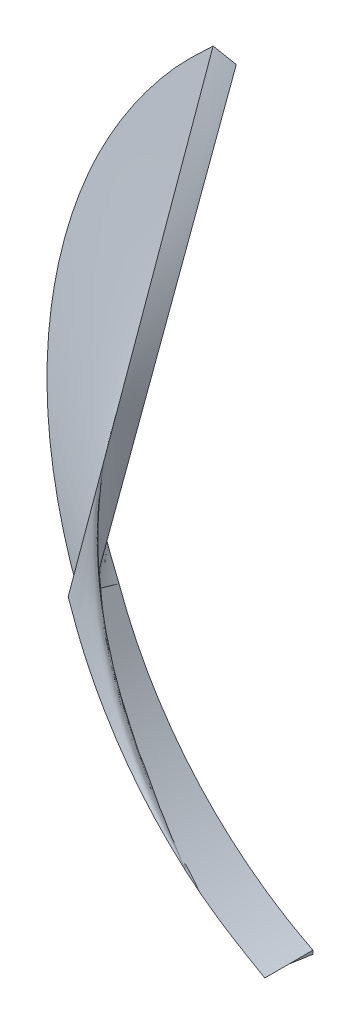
ISO-10303-21;
HEADER;
FILE_DESCRIPTION(('STEP AP214'),'2;1');
FILE_NAME('part.step','',(''),(''),'','','');
FILE_SCHEMA(('AUTOMOTIVE_DESIGN { 1 0 10303 214 1 1 1 1 }'));
ENDSEC;
DATA;
#1=APPLICATION_CONTEXT('core data for automotive mechanical design processes');
#2=APPLICATION_PROTOCOL_DEFINITION('international standard','automotive_design',2000,#1);
#3=PRODUCT_CONTEXT('',#1,'mechanical');
#4=PRODUCT('Part','Part','',(#3));
#5=PRODUCT_RELATED_PRODUCT_CATEGORY('part','',(#4));
#6=PRODUCT_DEFINITION_FORMATION('','',#4);
#7=PRODUCT_DEFINITION_CONTEXT('part definition',#1,'design');
#8=PRODUCT_DEFINITION('design','',#6,#7);
#9=PRODUCT_DEFINITION_SHAPE('','',#8);
#10=(LENGTH_UNIT() NAMED_UNIT(*) SI_UNIT(.MILLI.,.METRE.));
#11=(NAMED_UNIT(*) PLANE_ANGLE_UNIT() SI_UNIT($,.RADIAN.));
#12=(NAMED_UNIT(*) SI_UNIT($,.STERADIAN.) SOLID_ANGLE_UNIT());
#13=UNCERTAINTY_MEASURE_WITH_UNIT(LENGTH_MEASURE(1.E-05),#10,'distance_accuracy_value','');
#14=(GEOMETRIC_REPRESENTATION_CONTEXT(3) GLOBAL_UNCERTAINTY_ASSIGNED_CONTEXT((#13)) GLOBAL_UNIT_ASSIGNED_CONTEXT((#10,
#11,#12)) REPRESENTATION_CONTEXT('',''));
#15=CARTESIAN_POINT('',(0.,0.,0.));
#16=DIRECTION('',(0.,0.,1.));
#17=DIRECTION('',(1.,0.,0.));
#18=AXIS2_PLACEMENT_3D('',#15,#16,#17);
#19=CARTESIAN_POINT('',(-28.2525641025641,-60.4671431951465,22.6547696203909));
#20=DIRECTION('',(0.,0.,-1.));
#21=DIRECTION('',(-1.,0.,0.));
#22=AXIS2_PLACEMENT_3D('',#19,#20,#21);
#23=CYLINDRICAL_SURFACE('',#22,17.5);
#24=CARTESIAN_POINT('',(-35.7525641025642,-76.2785314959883,6.32363904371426));
#25=DIRECTION('',(0.,0.,-1.));
#26=VECTOR('',#25,1.);
#27=LINE('',#24,#26);
#28=CARTESIAN_POINT('',(-35.7525641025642,-76.2785314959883,6.32363904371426));
#29=VERTEX_POINT('',#28);
#30=CARTESIAN_POINT('',(-35.7525641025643,-76.2785314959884,5.28894384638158));
#31=VERTEX_POINT('',#30);
#32=EDGE_CURVE('E137',#29,#31,#27,.T.);
#33=ORIENTED_EDGE('',*,*,#32,.T.);
#34=CARTESIAN_POINT('',(-28.2525641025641,-60.4671431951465,4.69415557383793));
#35=DIRECTION('',(0.,0.03759112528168,0.999293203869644));
#36=DIRECTION('',(0.,0.999293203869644,-0.03759112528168));
#37=AXIS2_PLACEMENT_3D('',#34,#35,#36);
#38=ELLIPSE('',#37,17.5123776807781,17.5);
#39=CARTESIAN_POINT('',(-44.4232075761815,-67.157456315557,4.94582985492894));
#40=VERTEX_POINT('',#39);
#41=EDGE_CURVE('E147',#40,#31,#38,.T.);
#42=ORIENTED_EDGE('',*,*,#41,.F.);
#43=CARTESIAN_POINT('',(-44.5128678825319,-66.9365029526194,5.9505367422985));
#44=CARTESIAN_POINT('',(-44.5092847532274,-66.9455089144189,5.90861779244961));
#45=CARTESIAN_POINT('',(-44.5056831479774,-66.9545394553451,5.86670570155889));
#46=CARTESIAN_POINT('',(-44.4984425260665,-66.9726500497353,5.78289536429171));
#47=CARTESIAN_POINT('',(-44.494803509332,-66.9817301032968,5.74099711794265));
#48=CARTESIAN_POINT('',(-44.4874876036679,-66.9999400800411,5.65721458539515));
#49=CARTESIAN_POINT('',(-44.4838107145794,-67.0090700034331,5.61533029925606));
#50=CARTESIAN_POINT('',(-44.4764186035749,-67.0273800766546,5.53157580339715));
#51=CARTESIAN_POINT('',(-44.4727033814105,-67.0365602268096,5.48970559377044));
#52=CARTESIAN_POINT('',(-44.4652341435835,-67.0549711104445,5.40597936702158));
#53=CARTESIAN_POINT('',(-44.4614801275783,-67.064201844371,5.36412335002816));
#54=CARTESIAN_POINT('',(-44.4539328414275,-67.0827142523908,5.28042562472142));
#55=CARTESIAN_POINT('',(-44.4501395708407,-67.0919959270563,5.23858391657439));
#56=CARTESIAN_POINT('',(-44.4425133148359,-67.110610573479,5.15491492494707));
#57=CARTESIAN_POINT('',(-44.4386803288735,-67.1199435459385,5.11308764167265));
#58=CARTESIAN_POINT('',(-44.4309741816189,-67.138661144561,5.02944761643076));
#59=CARTESIAN_POINT('',(-44.4271010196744,-67.1480457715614,4.9876348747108));
#60=CARTESIAN_POINT('',(-44.4232075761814,-67.1574563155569,4.94582985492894));
#61=B_SPLINE_CURVE_WITH_KNOTS('',3,(#43,#44,#45,#46,#47,#48,#49,#50,#51,#52,#53,#54,#55,#56,#57,
#58,#59,#60),.UNSPECIFIED.,.F.,.F.,(4,2,2,2,2,2,2,2,4),(0.,0.129074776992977,0.258149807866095,
0.387225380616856,0.516301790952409,0.645379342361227,0.774458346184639,0.903539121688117,
1.0326219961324),.UNSPECIFIED.);
#62=CARTESIAN_POINT('',(-44.5128670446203,-66.9365026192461,5.9505367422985));
#63=VERTEX_POINT('',#62);
#64=EDGE_CURVE('E258',#63,#40,#61,.T.);
#65=ORIENTED_EDGE('',*,*,#64,.F.);
#66=CARTESIAN_POINT('',(-44.5954336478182,-66.7249874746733,6.95787947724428));
#67=CARTESIAN_POINT('',(-44.5866276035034,-66.7479851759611,6.8458126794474));
#68=CARTESIAN_POINT('',(-44.568778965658,-66.7943098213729,6.62177009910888));
#69=CARTESIAN_POINT('',(-44.541270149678,-66.8648048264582,6.28598588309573));
#70=CARTESIAN_POINT('',(-44.5224228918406,-66.9124870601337,6.06232058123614));
#71=CARTESIAN_POINT('',(-44.5128678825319,-66.9365029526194,5.9505367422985));
#72=B_SPLINE_CURVE_WITH_KNOTS('',3,(#66,#67,#68,#69,#70,#71),.UNSPECIFIED.,.F.,.F.,(4,1,1,4),
(0.,0.166666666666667,0.333333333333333,0.5),.UNSPECIFIED.);
#73=CARTESIAN_POINT('',(-44.5954336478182,-66.7249874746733,6.95787947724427));
#74=VERTEX_POINT('',#73);
#75=EDGE_CURVE('E282',#74,#63,#72,.T.);
#76=ORIENTED_EDGE('',*,*,#75,.F.);
#77=CARTESIAN_POINT('',(-35.7525641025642,-76.2785314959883,7.35833424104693));
#78=CARTESIAN_POINT('',(-35.7854644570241,-76.2607661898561,7.35758957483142));
#79=CARTESIAN_POINT('',(-36.0268619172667,-76.130418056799,7.35212578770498));
#80=CARTESIAN_POINT('',(-36.2893312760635,-75.9883176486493,7.34616938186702));
#81=CARTESIAN_POINT('',(-36.7388587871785,-75.7404516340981,7.33577961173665));
#82=CARTESIAN_POINT('',(-37.1924590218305,-75.4850775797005,7.3250751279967));
#83=CARTESIAN_POINT('',(-37.6430114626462,-75.2137593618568,7.31370231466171));
#84=CARTESIAN_POINT('',(-38.0501706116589,-74.9555704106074,7.3028798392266));
#85=CARTESIAN_POINT('',(-38.2762264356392,-74.8055966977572,7.29659340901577));
#86=CARTESIAN_POINT('',(-38.5031756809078,-74.6463093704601,7.28991658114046));
#87=CARTESIAN_POINT('',(-38.5914341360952,-74.5833726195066,7.28727846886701));
#88=CARTESIAN_POINT('',(-38.6847769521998,-74.515609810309,7.28443806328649));
#89=CARTESIAN_POINT('',(-38.7831092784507,-74.4428658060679,7.28138886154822));
#90=CARTESIAN_POINT('',(-38.8809306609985,-74.3691681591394,7.27829968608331));
#91=CARTESIAN_POINT('',(-39.0375141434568,-74.2491012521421,7.27326685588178));
#92=CARTESIAN_POINT('',(-39.2567447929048,-74.0754376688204,7.26598742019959));
#93=CARTESIAN_POINT('',(-39.5619663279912,-73.8224785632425,7.2553841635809));
#94=CARTESIAN_POINT('',(-39.8358890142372,-73.5843321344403,7.2454018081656));
#95=CARTESIAN_POINT('',(-40.056881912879,-73.3851932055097,7.23705452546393));
#96=CARTESIAN_POINT('',(-40.2632005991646,-73.1948837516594,7.22907734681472));
#97=CARTESIAN_POINT('',(-40.4365810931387,-73.0291979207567,7.22213231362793));
#98=CARTESIAN_POINT('',(-40.6367752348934,-72.8318104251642,7.21385844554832));
#99=CARTESIAN_POINT('',(-40.8345546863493,-72.6320066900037,7.2054832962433));
#100=CARTESIAN_POINT('',(-41.0966759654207,-72.3557985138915,7.19390551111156));
#101=CARTESIAN_POINT('',(-41.3518328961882,-72.0731504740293,7.18205778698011));
#102=CARTESIAN_POINT('',(-41.5358559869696,-71.8604809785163,7.17314334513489));
#103=CARTESIAN_POINT('',(-41.7171974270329,-71.6456515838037,7.16413836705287));
#104=CARTESIAN_POINT('',(-41.8689556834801,-71.4599945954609,7.15635620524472));
#105=CARTESIAN_POINT('',(-42.0429913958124,-71.2395662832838,7.14711653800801));
#106=CARTESIAN_POINT('',(-42.2244898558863,-71.0038679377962,7.13723679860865));
#107=CARTESIAN_POINT('',(-42.4395101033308,-70.7121599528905,7.1250093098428));
#108=CARTESIAN_POINT('',(-42.6666025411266,-70.3882198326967,7.11143075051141));
#109=CARTESIAN_POINT('',(-42.8225117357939,-70.1561876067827,7.10170468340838));
#110=CARTESIAN_POINT('',(-42.9305711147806,-69.9908841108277,7.09477567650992));
#111=CARTESIAN_POINT('',(-42.9970217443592,-69.8877605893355,7.09045306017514));
#112=CARTESIAN_POINT('',(-43.0629184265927,-69.7840216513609,7.08610464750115));
#113=CARTESIAN_POINT('',(-43.12434906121,-69.6859180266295,7.08199244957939));
#114=CARTESIAN_POINT('',(-43.1815946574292,-69.5932974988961,7.07811008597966));
#115=CARTESIAN_POINT('',(-43.3266974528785,-69.3556665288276,7.06814933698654));
#116=CARTESIAN_POINT('',(-43.464396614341,-69.1197074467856,7.05825866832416));
#117=CARTESIAN_POINT('',(-43.7006136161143,-68.6937040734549,7.04040193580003));
#118=CARTESIAN_POINT('',(-43.9447201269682,-68.2250224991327,7.02075626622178));
#119=CARTESIAN_POINT('',(-44.1594154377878,-67.7521943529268,7.00093678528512));
#120=CARTESIAN_POINT('',(-44.3623061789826,-67.2851650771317,6.98136037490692));
#121=CARTESIAN_POINT('',(-44.4766362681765,-67.0112592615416,6.96987909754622));
#122=CARTESIAN_POINT('',(-44.5811846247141,-66.7593240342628,6.95931875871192));
#123=CARTESIAN_POINT('',(-44.5954336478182,-66.7249874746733,6.95787947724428));
#124=B_SPLINE_CURVE_WITH_KNOTS('',3,(#77,#78,#79,#80,#81,#82,#83,#84,#85,#86,#87,#88,#89,#90,
#91,#92,#93,#94,#95,#96,#97,#98,#99,#100,#101,#102,#103,#104,#105,#106,#107,#108,#109,#110,#111,
#112,#113,#114,#115,#116,#117,#118,#119,#120,#121,#122,#123),.UNSPECIFIED.,.F.,.F.,(4,1,1,1,1,1,
1,1,1,1,1,1,1,1,1,1,1,1,1,1,1,1,1,1,1,1,1,1,1,1,1,1,1,1,1,1,1,1,1,1,1,1,1,1,4),(0.,
0.0085182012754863,0.0625,0.0679937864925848,0.125427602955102,0.181004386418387,0.1875,
0.234747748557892,0.242373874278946,0.25,0.259154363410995,0.268308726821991,0.277463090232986,
0.286617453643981,0.3125,0.339963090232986,0.375,0.393308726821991,0.406220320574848,0.4375,
0.446654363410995,0.468740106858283,0.5,0.531259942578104,0.553345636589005,0.562519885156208,
0.593779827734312,0.606691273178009,0.625039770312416,0.660036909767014,0.6875,
0.713382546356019,0.722536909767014,0.731691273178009,0.740845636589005,0.750061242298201,
0.757626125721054,0.765252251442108,0.8125,0.818995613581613,0.875028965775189,
0.932006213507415,0.9375,0.991481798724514,1.),.UNSPECIFIED.);
#125=CARTESIAN_POINT('',(-35.7525641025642,-76.2785314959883,7.35833424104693));
#126=VERTEX_POINT('',#125);
#127=EDGE_CURVE('E123',#126,#74,#124,.T.);
#128=ORIENTED_EDGE('',*,*,#127,.F.);
#129=CARTESIAN_POINT('',(-35.7525641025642,-76.2785314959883,6.32363904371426));
#130=CARTESIAN_POINT('',(-35.7525641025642,-76.2785314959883,6.43860517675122));
#131=CARTESIAN_POINT('',(-35.7525641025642,-76.2785314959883,6.66853744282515));
#132=CARTESIAN_POINT('',(-35.7525641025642,-76.2785314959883,7.01343584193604));
#133=CARTESIAN_POINT('',(-35.7525641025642,-76.2785314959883,7.24336810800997));
#134=CARTESIAN_POINT('',(-35.7525641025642,-76.2785314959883,7.35833424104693));
#135=B_SPLINE_CURVE_WITH_KNOTS('',3,(#129,#130,#131,#132,#133,#134),.UNSPECIFIED.,.F.,.F.,(4,1,
1,4),(0.,0.166666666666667,0.333333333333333,0.5),.UNSPECIFIED.);
#136=EDGE_CURVE('E141',#126,#29,#135,.F.);
#137=ORIENTED_EDGE('',*,*,#136,.T.);
#138=EDGE_LOOP('',(#33,#42,#65,#76,#128,#137));
#139=FACE_BOUND('',#138,.T.);
#140=ADVANCED_FACE('F103',(#139),#23,.F.);
#141=CARTESIAN_POINT('',(-35.7525641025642,-76.2785314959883,7.35833424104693));
#142=CARTESIAN_POINT('',(-35.7525641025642,-76.2785314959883,7.24336810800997));
#143=CARTESIAN_POINT('',(-35.7525641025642,-76.2785314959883,7.01343584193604));
#144=CARTESIAN_POINT('',(-35.7525641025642,-76.2785314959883,6.66853744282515));
#145=CARTESIAN_POINT('',(-35.7525641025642,-76.2785314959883,6.43860517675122));
#146=CARTESIAN_POINT('',(-35.7525641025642,-76.2785314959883,6.32363904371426));
#147=CARTESIAN_POINT('',(-39.5562566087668,-76.4318356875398,5.29471079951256));
#148=CARTESIAN_POINT('',(-39.1336241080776,-76.4318356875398,5.29471079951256));
#149=CARTESIAN_POINT('',(-38.2883591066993,-76.4318356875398,5.29471079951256));
#150=CARTESIAN_POINT('',(-37.0204616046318,-76.4318356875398,5.29471079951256));
#151=CARTESIAN_POINT('',(-36.1751966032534,-76.4318356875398,5.29471079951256));
#152=CARTESIAN_POINT('',(-35.7525641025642,-76.4318356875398,5.29471079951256));
#153=B_SPLINE_SURFACE_WITH_KNOTS('',1,3,((#141,#142,#143,#144,#145,#146),(#147,#148,#149,#150,
#151,#152)),.UNSPECIFIED.,.F.,.F.,.F.,(2,2),(4,1,1,4),(0.,1.),(0.,0.166666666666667,
0.333333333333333,0.5),.UNSPECIFIED.);
#154=DIRECTION('',(0.878422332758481,0.0354039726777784,0.476571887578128));
#155=VECTOR('',#154,1.);
#156=CARTESIAN_POINT('',(-37.6544103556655,-76.3551835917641,6.32652252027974));
#157=LINE('',#156,#155);
#158=CARTESIAN_POINT('',(-39.5562566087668,-76.4318356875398,5.29471079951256));
#159=VERTEX_POINT('',#158);
#160=EDGE_CURVE('E377',#159,#126,#157,.T.);
#161=CARTESIAN_POINT('',(-39.5562566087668,-76.4318356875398,5.29471079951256));
#162=CARTESIAN_POINT('',(-39.1336241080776,-76.4318356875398,5.29471079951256));
#163=CARTESIAN_POINT('',(-38.2883591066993,-76.4318356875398,5.29471079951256));
#164=CARTESIAN_POINT('',(-37.0204616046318,-76.4318356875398,5.29471079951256));
#165=CARTESIAN_POINT('',(-36.1751966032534,-76.4318356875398,5.29471079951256));
#166=CARTESIAN_POINT('',(-35.7525641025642,-76.4318356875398,5.29471079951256));
#167=B_SPLINE_CURVE_WITH_KNOTS('',3,(#161,#162,#163,#164,#165,#166),.UNSPECIFIED.,.F.,.F.,(4,1,
1,4),(0.,0.166666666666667,0.333333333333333,0.5),.UNSPECIFIED.);
#168=CARTESIAN_POINT('',(-35.7525641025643,-76.4318356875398,5.29471079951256));
#169=VERTEX_POINT('',#168);
#170=EDGE_CURVE('E164',#159,#169,#167,.T.);
#171=CARTESIAN_POINT('',(-35.7525641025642,-76.4318356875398,5.29471079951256));
#172=CARTESIAN_POINT('',(-35.7525641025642,-76.2785314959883,6.32363904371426));
#173=B_SPLINE_CURVE_WITH_KNOTS('',1,(#171,#172),.UNSPECIFIED.,.F.,.F.,(2,2),(0.,1.),.UNSPECIFIED.);
#174=EDGE_CURVE('E153',#29,#169,#173,.F.);
#175=ORIENTED_EDGE('',*,*,#160,.F.);
#176=ORIENTED_EDGE('',*,*,#170,.T.);
#177=ORIENTED_EDGE('',*,*,#174,.F.);
#178=ORIENTED_EDGE('',*,*,#136,.F.);
#179=EDGE_LOOP('',(#175,#176,#177,#178));
#180=FACE_BOUND('',#179,.T.);
#181=ADVANCED_FACE('F162',(#180),#153,.T.);
#182=CARTESIAN_POINT('',(-35.7525641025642,-76.2785314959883,6.32363904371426));
#183=DIRECTION('',(1.,0.,0.));
#184=DIRECTION('',(0.,-0.147367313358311,-0.989081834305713));
#185=AXIS2_PLACEMENT_3D('',#182,#183,#184);
#186=PLANE('',#185);
#187=ORIENTED_EDGE('',*,*,#174,.T.);
#188=CARTESIAN_POINT('',(-35.7525641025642,-76.4318356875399,5.29471079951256));
#189=DIRECTION('',(0.,0.999293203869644,-0.0375911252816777));
#190=VECTOR('',#189,1.);
#191=LINE('',#188,#190);
#192=EDGE_CURVE('E156',#169,#31,#191,.T.);
#193=ORIENTED_EDGE('',*,*,#192,.T.);
#194=ORIENTED_EDGE('',*,*,#32,.F.);
#195=EDGE_LOOP('',(#187,#193,#194));
#196=FACE_BOUND('',#195,.T.);
#197=ADVANCED_FACE('F105',(#196),#186,.T.);
#198=CARTESIAN_POINT('',(19.3167969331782,144.825406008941,-3.0284806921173));
#199=DIRECTION('',(0.,0.03759112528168,0.999293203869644));
#200=DIRECTION('',(0.,-0.999293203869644,0.03759112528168));
#201=AXIS2_PLACEMENT_3D('',#198,#199,#200);
#202=PLANE('',#201);
#203=CARTESIAN_POINT('',(-41.1819595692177,-45.9450403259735,4.14786727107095));
#204=CARTESIAN_POINT('',(-41.3056145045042,-46.0610902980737,4.15223280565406));
#205=CARTESIAN_POINT('',(-41.429267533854,-46.1771597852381,4.15659907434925));
#206=CARTESIAN_POINT('',(-41.6755860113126,-46.4105108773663,4.16537720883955));
#207=CARTESIAN_POINT('',(-41.7982506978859,-46.5277932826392,4.16978910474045));
#208=CARTESIAN_POINT('',(-42.0414385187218,-46.7645897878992,4.17869684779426));
#209=CARTESIAN_POINT('',(-42.1619615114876,-46.8841040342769,4.18319270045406));
#210=CARTESIAN_POINT('',(-42.340362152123,-47.0657416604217,4.19002549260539));
#211=CARTESIAN_POINT('',(-42.3994385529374,-47.1266892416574,4.19231820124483));
#212=CARTESIAN_POINT('',(-42.5166545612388,-47.2494768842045,4.19693719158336));
#213=CARTESIAN_POINT('',(-42.5747941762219,-47.3113169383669,4.19926347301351));
#214=CARTESIAN_POINT('',(-42.7476637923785,-47.4981996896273,4.20629357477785));
#215=CARTESIAN_POINT('',(-42.8608826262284,-47.6246435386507,4.2110501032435));
#216=CARTESIAN_POINT('',(-43.0835244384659,-47.8807978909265,4.22068604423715));
#217=CARTESIAN_POINT('',(-43.1929476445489,-48.0105081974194,4.22556544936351));
#218=CARTESIAN_POINT('',(-43.461719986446,-48.3381341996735,4.2378899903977));
#219=CARTESIAN_POINT('',(-43.6188338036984,-48.5378877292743,4.24540426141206));
#220=CARTESIAN_POINT('',(-43.8488884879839,-48.8417643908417,4.25683540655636));
#221=CARTESIAN_POINT('',(-43.924646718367,-48.9437776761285,4.26067291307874));
#222=CARTESIAN_POINT('',(-44.0742881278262,-49.1491683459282,4.26839924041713));
#223=CARTESIAN_POINT('',(-44.1481713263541,-49.252545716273,4.27228806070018));
#224=CARTESIAN_POINT('',(-44.3668739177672,-49.5646682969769,4.28402939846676));
#225=CARTESIAN_POINT('',(-44.5087872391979,-49.7754579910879,4.29195882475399));
#226=CARTESIAN_POINT('',(-44.7843965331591,-50.2022878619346,4.3080151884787));
#227=CARTESIAN_POINT('',(-44.9180939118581,-50.4183271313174,4.31614209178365));
#228=CARTESIAN_POINT('',(-45.1239472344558,-50.7660698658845,4.32922337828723));
#229=CARTESIAN_POINT('',(-45.198906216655,-50.8961228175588,4.3341156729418));
#230=CARTESIAN_POINT('',(-45.345762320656,-51.1579390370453,4.34396460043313));
#231=CARTESIAN_POINT('',(-45.4176594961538,-51.2897022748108,4.3489212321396));
#232=CARTESIAN_POINT('',(-45.6286548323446,-51.6874119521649,4.36388216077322));
#233=CARTESIAN_POINT('',(-45.7630970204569,-51.9558462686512,4.37398004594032));
#234=CARTESIAN_POINT('',(-46.0188951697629,-52.4985639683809,4.39439584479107));
#235=CARTESIAN_POINT('',(-46.1402627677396,-52.7728418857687,4.40471355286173));
#236=CARTESIAN_POINT('',(-46.3698985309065,-53.3268551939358,4.42555426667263));
#237=CARTESIAN_POINT('',(-46.4781653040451,-53.6065911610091,4.43607729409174));
#238=CARTESIAN_POINT('',(-46.6729165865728,-54.1466496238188,4.45639305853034));
#239=CARTESIAN_POINT('',(-46.7604719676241,-54.4065875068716,4.46617132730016));
#240=CARTESIAN_POINT('',(-46.9245670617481,-54.9299417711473,4.4858587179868));
#241=CARTESIAN_POINT('',(-47.0011056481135,-55.193358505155,4.49576785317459));
#242=CARTESIAN_POINT('',(-47.143276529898,-55.7234757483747,4.51570965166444));
#243=CARTESIAN_POINT('',(-47.2088947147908,-55.9901800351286,4.525742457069));
#244=CARTESIAN_POINT('',(-47.3290902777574,-56.5260325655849,4.54590000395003));
#245=CARTESIAN_POINT('',(-47.3836685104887,-56.7951806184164,4.55602473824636));
#246=CARTESIAN_POINT('',(-47.4987468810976,-57.4292284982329,4.57987616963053));
#247=CARTESIAN_POINT('',(-47.5547336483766,-57.7949561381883,4.59363400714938));
#248=CARTESIAN_POINT('',(-47.6462520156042,-58.5290850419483,4.62125025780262));
#249=CARTESIAN_POINT('',(-47.6817763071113,-58.8974872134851,4.63510870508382));
#250=CARTESIAN_POINT('',(-47.7319088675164,-59.6357554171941,4.66288066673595));
#251=CARTESIAN_POINT('',(-47.7465150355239,-60.0056215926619,4.67679418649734));
#252=CARTESIAN_POINT('',(-47.7543398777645,-60.7454569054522,4.70462509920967));
#253=CARTESIAN_POINT('',(-47.7475664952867,-61.1154259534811,4.71854248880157));
#254=CARTESIAN_POINT('',(-47.7119573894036,-61.854241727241,4.74633504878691));
#255=CARTESIAN_POINT('',(-47.6831252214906,-62.223088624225,4.76021022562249));
#256=CARTESIAN_POINT('',(-47.6041089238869,-62.9583387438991,4.78786865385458));
#257=CARTESIAN_POINT('',(-47.5539333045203,-63.3247428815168,4.80165193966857));
#258=CARTESIAN_POINT('',(-47.449448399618,-63.9542637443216,4.82533307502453));
#259=CARTESIAN_POINT('',(-47.4000293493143,-64.2182019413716,4.83526182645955));
#260=CARTESIAN_POINT('',(-47.2904910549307,-64.7437905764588,4.85503326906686));
#261=CARTESIAN_POINT('',(-47.2303738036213,-65.0054414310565,4.86487597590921));
#262=CARTESIAN_POINT('',(-47.0343701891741,-65.7860133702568,4.8942393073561));
#263=CARTESIAN_POINT('',(-46.8827457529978,-66.3010700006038,4.91361456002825));
#264=CARTESIAN_POINT('',(-46.538641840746,-67.3174212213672,4.95184736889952));
#265=CARTESIAN_POINT('',(-46.3461598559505,-67.8187149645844,4.97070489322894));
#266=CARTESIAN_POINT('',(-46.0271793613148,-68.5577130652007,4.99850431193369));
#267=CARTESIAN_POINT('',(-45.9157491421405,-68.8020022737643,5.00769391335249));
#268=CARTESIAN_POINT('',(-45.6827781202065,-69.2857888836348,5.02589285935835));
#269=CARTESIAN_POINT('',(-45.5612359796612,-69.5252856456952,5.03490217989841));
#270=CARTESIAN_POINT('',(-45.3710586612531,-69.8810325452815,5.04828456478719));
#271=CARTESIAN_POINT('',(-45.3061914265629,-69.9993095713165,5.05273387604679));
#272=CARTESIAN_POINT('',(-45.1738876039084,-70.2344201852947,5.06157819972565));
#273=CARTESIAN_POINT('',(-45.1064510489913,-70.351253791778,5.06597321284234));
#274=CARTESIAN_POINT('',(-44.9691023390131,-70.5834729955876,5.07470876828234));
#275=CARTESIAN_POINT('',(-44.8991899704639,-70.6988584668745,5.07904930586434));
#276=CARTESIAN_POINT('',(-44.7569552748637,-70.9281362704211,5.08767421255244));
#277=CARTESIAN_POINT('',(-44.6846328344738,-71.0420285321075,5.09195857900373));
#278=CARTESIAN_POINT('',(-44.3169916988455,-71.6077597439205,5.11324009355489));
#279=CARTESIAN_POINT('',(-44.0037279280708,-72.0481763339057,5.12980755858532));
#280=CARTESIAN_POINT('',(-43.3418357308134,-72.9018374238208,5.16192033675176));
#281=CARTESIAN_POINT('',(-42.9931870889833,-73.3150661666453,5.17746505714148));
#282=CARTESIAN_POINT('',(-42.2631739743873,-74.1113580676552,5.20741973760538));
#283=CARTESIAN_POINT('',(-41.881825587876,-74.4944358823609,5.22183024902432));
#284=CARTESIAN_POINT('',(-41.333290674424,-75.0025612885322,5.24094476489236));
#285=CARTESIAN_POINT('',(-41.178670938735,-75.1413737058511,5.24616657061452));
#286=CARTESIAN_POINT('',(-40.8651592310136,-75.4140509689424,5.2564240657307));
#287=CARTESIAN_POINT('',(-40.7062682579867,-75.5479169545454,5.26145979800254));
#288=CARTESIAN_POINT('',(-40.4649378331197,-75.7445620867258,5.26885713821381));
#289=CARTESIAN_POINT('',(-40.3841116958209,-75.8093295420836,5.27129354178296));
#290=CARTESIAN_POINT('',(-40.2213882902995,-75.9375096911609,5.27611538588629));
#291=CARTESIAN_POINT('',(-40.1394910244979,-76.0009223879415,5.27850082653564));
#292=CARTESIAN_POINT('',(-40.0158286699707,-76.0949901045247,5.28203943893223));
#293=CARTESIAN_POINT('',(-39.9744660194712,-76.1261750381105,5.28321254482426));
#294=CARTESIAN_POINT('',(-39.8914760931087,-76.188192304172,5.28554549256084));
#295=CARTESIAN_POINT('',(-39.8498488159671,-76.219024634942,5.28670533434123));
#296=CARTESIAN_POINT('',(-39.7663095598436,-76.2803011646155,5.2890104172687));
#297=CARTESIAN_POINT('',(-39.7243975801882,-76.3107453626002,5.29015565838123));
#298=CARTESIAN_POINT('',(-39.6404149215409,-76.3714135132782,5.29243785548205));
#299=CARTESIAN_POINT('',(-39.5983442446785,-76.401637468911,5.29357481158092));
#300=CARTESIAN_POINT('',(-39.5562566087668,-76.4318356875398,5.29471079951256));
#301=B_SPLINE_CURVE_WITH_KNOTS('',3,(#203,#204,#205,#206,#207,#208,#209,#210,#211,#212,#213,
#214,#215,#216,#217,#218,#219,#220,#221,#222,#223,#224,#225,#226,#227,#228,#229,#230,#231,#232,
#233,#234,#235,#236,#237,#238,#239,#240,#241,#242,#243,#244,#245,#246,#247,#248,#249,#250,#251,
#252,#253,#254,#255,#256,#257,#258,#259,#260,#261,#262,#263,#264,#265,#266,#267,#268,#269,#270,
#271,#272,#273,#274,#275,#276,#277,#278,#279,#280,#281,#282,#283,#284,#285,#286,#287,#288,#289,
#290,#291,#292,#293,#294,#295,#296,#297,#298,#299,#300),.UNSPECIFIED.,.F.,.F.,(4,2,2,2,2,2,2,2,
2,2,2,2,2,2,2,2,2,2,2,2,2,2,2,2,2,2,2,2,2,2,2,2,2,2,2,2,2,2,2,2,2,2,2,2,2,2,2,2,4),(0.,
0.508935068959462,1.01823061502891,1.52755968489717,1.78228432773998,2.0370069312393,
2.54628960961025,3.05554168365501,3.81806492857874,4.19942424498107,4.58077960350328,
5.34328704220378,6.10566361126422,6.55619027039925,7.00670902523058,7.90750985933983,
8.8075022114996,9.70759011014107,10.5307355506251,11.3539651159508,12.178250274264,
13.0024715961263,14.1126090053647,15.2231426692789,16.3337878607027,17.4440204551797,
18.5540741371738,19.6636856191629,20.4695925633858,21.2753495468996,22.885297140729,
24.4953436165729,25.3011370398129,26.1070372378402,26.5119225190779,26.9168025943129,
27.3217176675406,27.7266518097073,29.3466603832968,30.9675997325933,32.5877462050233,
33.2112430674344,33.834595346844,34.1453942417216,34.4561924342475,34.6116346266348,
34.7670775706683,34.9225208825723,35.077962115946),.UNSPECIFIED.);
#302=CARTESIAN_POINT('',(-41.1819595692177,-45.9450403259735,4.14786727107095));
#303=VERTEX_POINT('',#302);
#304=EDGE_CURVE('E114',#303,#159,#301,.T.);
#305=ORIENTED_EDGE('',*,*,#304,.F.);
#306=CARTESIAN_POINT('',(-40.1797824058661,-46.1285270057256,4.15476962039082));
#307=CARTESIAN_POINT('',(-40.2911354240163,-46.1081395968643,4.15400269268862));
#308=CARTESIAN_POINT('',(-40.5138414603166,-46.0673647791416,4.1524688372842));
#309=CARTESIAN_POINT('',(-40.8479005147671,-46.0062025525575,4.15016805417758));
#310=CARTESIAN_POINT('',(-41.0706065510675,-45.9654277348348,4.14863419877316));
#311=CARTESIAN_POINT('',(-41.1819595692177,-45.9450403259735,4.14786727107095));
#312=B_SPLINE_CURVE_WITH_KNOTS('',3,(#306,#307,#308,#309,#310,#311),.UNSPECIFIED.,.F.,.F.,(4,1,
1,4),(0.,0.166666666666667,0.333333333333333,0.5),.UNSPECIFIED.);
#313=CARTESIAN_POINT('',(-40.1797824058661,-46.1285270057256,4.15476962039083));
#314=VERTEX_POINT('',#313);
#315=EDGE_CURVE('E302',#303,#314,#312,.F.);
#316=ORIENTED_EDGE('',*,*,#315,.T.);
#317=CARTESIAN_POINT('',(-44.4232075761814,-67.1574563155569,4.94582985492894));
#318=CARTESIAN_POINT('',(-45.6092464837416,-64.773202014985,4.85613966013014));
#319=CARTESIAN_POINT('',(-46.8022853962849,-59.6696880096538,4.66415713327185));
#320=CARTESIAN_POINT('',(-45.2767825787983,-52.1098302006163,4.37977256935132));
#321=CARTESIAN_POINT('',(-42.1977769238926,-47.867153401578,4.22017276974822));
#322=CARTESIAN_POINT('',(-40.1797824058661,-46.1285270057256,4.15476962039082));
#323=B_SPLINE_CURVE_WITH_KNOTS('',3,(#317,#318,#319,#320,#321,#322),.UNSPECIFIED.,.F.,.F.,(4,1,
1,4),(0.5,0.666666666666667,0.833333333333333,1.),.UNSPECIFIED.);
#324=EDGE_CURVE('E278',#314,#40,#323,.F.);
#325=ORIENTED_EDGE('',*,*,#324,.T.);
#326=ORIENTED_EDGE('',*,*,#41,.T.);
#327=ORIENTED_EDGE('',*,*,#192,.F.);
#328=ORIENTED_EDGE('',*,*,#170,.F.);
#329=EDGE_LOOP('',(#305,#316,#325,#326,#327,#328));
#330=FACE_BOUND('',#329,.T.);
#331=ADVANCED_FACE('F184',(#330),#202,.F.);
#332=CARTESIAN_POINT('',(-44.5954336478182,-66.7249874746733,6.95787947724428));
#333=CARTESIAN_POINT('',(-44.5866276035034,-66.7479851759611,6.8458126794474));
#334=CARTESIAN_POINT('',(-44.568778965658,-66.7943098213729,6.62177009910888));
#335=CARTESIAN_POINT('',(-44.541270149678,-66.8648048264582,6.28598588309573));
#336=CARTESIAN_POINT('',(-44.5224228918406,-66.9124870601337,6.06232058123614));
#337=CARTESIAN_POINT('',(-44.5128678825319,-66.9365029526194,5.9505367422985));
#338=CARTESIAN_POINT('',(-41.1819595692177,-45.9450403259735,4.14786727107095));
#339=CARTESIAN_POINT('',(-41.0706065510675,-45.9654277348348,4.14863419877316));
#340=CARTESIAN_POINT('',(-40.8479005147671,-46.0062025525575,4.15016805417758));
#341=CARTESIAN_POINT('',(-40.5138414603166,-46.0673647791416,4.1524688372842));
#342=CARTESIAN_POINT('',(-40.2911354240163,-46.1081395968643,4.15400269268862));
#343=CARTESIAN_POINT('',(-40.1797824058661,-46.1285270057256,4.15476962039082));
#344=B_SPLINE_SURFACE_WITH_KNOTS('',1,3,((#332,#333,#334,#335,#336,#337),(#338,#339,#340,#341,
#342,#343)),.UNSPECIFIED.,.F.,.F.,.F.,(2,2),(4,1,1,4),(0.,1.),(0.,0.166666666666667,
0.333333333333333,0.5),.UNSPECIFIED.);
#345=DIRECTION('',(0.160671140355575,0.97810551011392,-0.13226638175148));
#346=VECTOR('',#345,1.);
#347=CARTESIAN_POINT('',(-42.8886966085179,-56.3350139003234,5.55287337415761));
#348=LINE('',#347,#346);
#349=EDGE_CURVE('E12',#74,#303,#348,.T.);
#350=CARTESIAN_POINT('',(-44.5128678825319,-66.9365029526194,5.9505367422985));
#351=CARTESIAN_POINT('',(-40.1797824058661,-46.1285270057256,4.15476962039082));
#352=B_SPLINE_CURVE_WITH_KNOTS('',1,(#350,#351),.UNSPECIFIED.,.F.,.F.,(2,2),(0.,1.),.UNSPECIFIED.);
#353=EDGE_CURVE('E268',#63,#314,#352,.T.);
#354=ORIENTED_EDGE('',*,*,#349,.F.);
#355=ORIENTED_EDGE('',*,*,#75,.T.);
#356=ORIENTED_EDGE('',*,*,#353,.T.);
#357=ORIENTED_EDGE('',*,*,#315,.F.);
#358=EDGE_LOOP('',(#354,#355,#356,#357));
#359=FACE_BOUND('',#358,.T.);
#360=ADVANCED_FACE('F210',(#359),#344,.F.);
#361=CARTESIAN_POINT('',(-44.5128678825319,-66.9365029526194,5.9505367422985));
#362=CARTESIAN_POINT('',(-44.5033128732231,-66.9605188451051,5.83875290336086));
#363=CARTESIAN_POINT('',(-44.4839400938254,-67.0089001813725,5.61528284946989));
#364=CARTESIAN_POINT('',(-44.4540664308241,-67.0825411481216,5.28037724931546));
#365=CARTESIAN_POINT('',(-44.4335901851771,-67.1323613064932,5.05731090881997));
#366=CARTESIAN_POINT('',(-44.4232075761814,-67.1574563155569,4.94582985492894));
#367=CARTESIAN_POINT('',(-40.1797824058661,-46.1285270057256,4.15476962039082));
#368=CARTESIAN_POINT('',(-42.1977769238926,-47.867153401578,4.22017276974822));
#369=CARTESIAN_POINT('',(-45.2767825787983,-52.1098302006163,4.37977256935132));
#370=CARTESIAN_POINT('',(-46.8022853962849,-59.6696880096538,4.66415713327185));
#371=CARTESIAN_POINT('',(-45.6092464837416,-64.773202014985,4.85613966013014));
#372=CARTESIAN_POINT('',(-44.4232075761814,-67.1574563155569,4.94582985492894));
#373=B_SPLINE_SURFACE_WITH_KNOTS('',1,3,((#361,#362,#363,#364,#365,#366),(#367,#368,#369,#370,
#371,#372)),.UNSPECIFIED.,.F.,.F.,.F.,(2,2),(4,1,1,4),(0.,1.),(0.5,0.666666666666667,
0.833333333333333,1.),.UNSPECIFIED.);
#374=ORIENTED_EDGE('',*,*,#353,.F.);
#375=ORIENTED_EDGE('',*,*,#64,.T.);
#376=ORIENTED_EDGE('',*,*,#324,.F.);
#377=EDGE_LOOP('',(#374,#375,#376));
#378=FACE_BOUND('',#377,.T.);
#379=ADVANCED_FACE('F221',(#378),#373,.F.);
#380=CARTESIAN_POINT('',(-44.5954336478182,-66.7249874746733,6.95787947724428));
#381=CARTESIAN_POINT('',(-44.5811846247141,-66.7593240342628,6.95931875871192));
#382=CARTESIAN_POINT('',(-44.4766362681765,-67.0112592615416,6.96987909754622));
#383=CARTESIAN_POINT('',(-44.3623061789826,-67.2851650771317,6.98136037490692));
#384=CARTESIAN_POINT('',(-44.1594154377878,-67.7521943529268,7.00093678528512));
#385=CARTESIAN_POINT('',(-43.9447201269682,-68.2250224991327,7.02075626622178));
#386=CARTESIAN_POINT('',(-43.7006136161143,-68.6937040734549,7.04040193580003));
#387=CARTESIAN_POINT('',(-43.464396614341,-69.1197074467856,7.05825866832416));
#388=CARTESIAN_POINT('',(-43.3266974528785,-69.3556665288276,7.06814933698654));
#389=CARTESIAN_POINT('',(-43.1815946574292,-69.5932974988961,7.07811008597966));
#390=CARTESIAN_POINT('',(-43.12434906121,-69.6859180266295,7.08199244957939));
#391=CARTESIAN_POINT('',(-43.0629184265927,-69.7840216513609,7.08610464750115));
#392=CARTESIAN_POINT('',(-42.9970217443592,-69.8877605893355,7.09045306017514));
#393=CARTESIAN_POINT('',(-42.9305711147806,-69.9908841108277,7.09477567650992));
#394=CARTESIAN_POINT('',(-42.8225117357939,-70.1561876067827,7.10170468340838));
#395=CARTESIAN_POINT('',(-42.6666025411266,-70.3882198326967,7.11143075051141));
#396=CARTESIAN_POINT('',(-42.4395101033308,-70.7121599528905,7.1250093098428));
#397=CARTESIAN_POINT('',(-42.2244898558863,-71.0038679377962,7.13723679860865));
#398=CARTESIAN_POINT('',(-42.0429913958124,-71.2395662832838,7.14711653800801));
#399=CARTESIAN_POINT('',(-41.8689556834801,-71.4599945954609,7.15635620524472));
#400=CARTESIAN_POINT('',(-41.7171974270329,-71.6456515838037,7.16413836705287));
#401=CARTESIAN_POINT('',(-41.5358559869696,-71.8604809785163,7.17314334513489));
#402=CARTESIAN_POINT('',(-41.3518328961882,-72.0731504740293,7.18205778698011));
#403=CARTESIAN_POINT('',(-41.0966759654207,-72.3557985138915,7.19390551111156));
#404=CARTESIAN_POINT('',(-40.8345546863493,-72.6320066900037,7.2054832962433));
#405=CARTESIAN_POINT('',(-40.6367752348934,-72.8318104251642,7.21385844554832));
#406=CARTESIAN_POINT('',(-40.4365810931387,-73.0291979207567,7.22213231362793));
#407=CARTESIAN_POINT('',(-40.2632005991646,-73.1948837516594,7.22907734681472));
#408=CARTESIAN_POINT('',(-40.056881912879,-73.3851932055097,7.23705452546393));
#409=CARTESIAN_POINT('',(-39.8358890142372,-73.5843321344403,7.2454018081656));
#410=CARTESIAN_POINT('',(-39.5619663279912,-73.8224785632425,7.2553841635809));
#411=CARTESIAN_POINT('',(-39.2567447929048,-74.0754376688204,7.26598742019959));
#412=CARTESIAN_POINT('',(-39.0375141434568,-74.2491012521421,7.27326685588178));
#413=CARTESIAN_POINT('',(-38.8809306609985,-74.3691681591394,7.27829968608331));
#414=CARTESIAN_POINT('',(-38.7831092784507,-74.4428658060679,7.28138886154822));
#415=CARTESIAN_POINT('',(-38.6847769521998,-74.515609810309,7.28443806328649));
#416=CARTESIAN_POINT('',(-38.5914341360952,-74.5833726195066,7.28727846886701));
#417=CARTESIAN_POINT('',(-38.5031756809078,-74.6463093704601,7.28991658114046));
#418=CARTESIAN_POINT('',(-38.2762264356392,-74.8055966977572,7.29659340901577));
#419=CARTESIAN_POINT('',(-38.0501706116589,-74.9555704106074,7.3028798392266));
#420=CARTESIAN_POINT('',(-37.6430114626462,-75.2137593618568,7.31370231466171));
#421=CARTESIAN_POINT('',(-37.1924590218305,-75.4850775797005,7.3250751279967));
#422=CARTESIAN_POINT('',(-36.7388587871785,-75.7404516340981,7.33577961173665));
#423=CARTESIAN_POINT('',(-36.2893312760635,-75.9883176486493,7.34616938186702));
#424=CARTESIAN_POINT('',(-36.0268619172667,-76.130418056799,7.35212578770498));
#425=CARTESIAN_POINT('',(-35.7854644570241,-76.2607661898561,7.35758957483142));
#426=CARTESIAN_POINT('',(-35.7525641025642,-76.2785314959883,7.35833424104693));
#427=CARTESIAN_POINT('',(-43.4576089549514,-59.7983384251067,6.02120874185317));
#428=CARTESIAN_POINT('',(-43.4695035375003,-59.8413096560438,6.0229236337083));
#429=CARTESIAN_POINT('',(-43.5567768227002,-60.156599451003,6.03550618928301));
#430=CARTESIAN_POINT('',(-43.6504485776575,-60.5016071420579,6.04926963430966));
#431=CARTESIAN_POINT('',(-43.795658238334,-61.1164623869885,6.07373764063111));
#432=CARTESIAN_POINT('',(-43.9265247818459,-61.7668768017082,6.09955992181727));
#433=CARTESIAN_POINT('',(-44.0157282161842,-62.4511454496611,6.12664383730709));
#434=CARTESIAN_POINT('',(-44.0737010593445,-63.094726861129,6.15207487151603));
#435=CARTESIAN_POINT('',(-44.0944692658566,-63.4617666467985,6.16655835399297));
#436=CARTESIAN_POINT('',(-44.1024467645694,-63.842006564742,6.18154318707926));
#437=CARTESIAN_POINT('',(-44.1041233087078,-63.9913617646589,6.18742704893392));
#438=CARTESIAN_POINT('',(-44.1041909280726,-64.150903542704,6.19370982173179));
#439=CARTESIAN_POINT('',(-44.1022398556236,-64.3211390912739,6.2004110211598));
#440=CARTESIAN_POINT('',(-44.0982503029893,-64.4918535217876,6.20712847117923));
#441=CARTESIAN_POINT('',(-44.0884932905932,-64.7678472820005,6.21798450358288));
#442=CARTESIAN_POINT('',(-44.0655253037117,-65.1614595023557,6.23345632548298));
#443=CARTESIAN_POINT('',(-44.0125014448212,-65.7234592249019,6.25552591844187));
#444=CARTESIAN_POINT('',(-43.9413568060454,-66.2419632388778,6.27586692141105));
#445=CARTESIAN_POINT('',(-43.8666105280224,-66.6687718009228,6.29259802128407));
#446=CARTESIAN_POINT('',(-43.7869041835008,-67.0720543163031,6.30840035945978));
#447=CARTESIAN_POINT('',(-43.70774511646,-67.416498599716,6.3218896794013));
#448=CARTESIAN_POINT('',(-43.6026526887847,-67.8196839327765,6.33767231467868));
#449=CARTESIAN_POINT('',(-43.4879654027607,-68.2222522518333,6.35342554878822));
#450=CARTESIAN_POINT('',(-43.310214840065,-68.7643060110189,6.37462647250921));
#451=CARTESIAN_POINT('',(-43.1054583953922,-69.300916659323,6.39560418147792));
#452=CARTESIAN_POINT('',(-42.9379331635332,-69.6925076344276,6.41090759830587));
#453=CARTESIAN_POINT('',(-42.7611211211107,-70.0808800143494,6.4260830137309));
#454=CARTESIAN_POINT('',(-42.6001890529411,-70.4083972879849,6.43887833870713));
#455=CARTESIAN_POINT('',(-42.3992927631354,-70.7862011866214,6.45363590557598));
#456=CARTESIAN_POINT('',(-42.1772954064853,-71.1822101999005,6.46910361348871));
#457=CARTESIAN_POINT('',(-41.8884013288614,-71.6555067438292,6.48759050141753));
#458=CARTESIAN_POINT('',(-41.5502645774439,-72.1579028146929,6.50721450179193));
#459=CARTESIAN_POINT('',(-41.2982814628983,-72.5026371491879,6.52068035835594));
#460=CARTESIAN_POINT('',(-41.1143614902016,-72.7409112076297,6.52998780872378));
#461=CARTESIAN_POINT('',(-40.9982193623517,-72.8871437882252,6.5356999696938));
#462=CARTESIAN_POINT('',(-40.8802631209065,-73.0314639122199,6.54133745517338));
#463=CARTESIAN_POINT('',(-40.7671691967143,-73.1658855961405,6.54658830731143));
#464=CARTESIAN_POINT('',(-40.6593334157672,-73.2907150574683,6.55146448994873));
#465=CARTESIAN_POINT('',(-40.3801130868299,-73.6065002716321,6.5638001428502));
#466=CARTESIAN_POINT('',(-40.0952837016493,-73.9029918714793,6.57538332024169));
#467=CARTESIAN_POINT('',(-39.5725413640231,-74.4086271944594,6.5951441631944));
#468=CARTESIAN_POINT('',(-38.9822460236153,-74.9331515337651,6.61565319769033));
#469=CARTESIAN_POINT('',(-38.371449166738,-75.4051207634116,6.63413953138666));
#470=CARTESIAN_POINT('',(-37.7598633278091,-75.8465850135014,6.65145681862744));
#471=CARTESIAN_POINT('',(-37.3994581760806,-76.0900497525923,6.66102268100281));
#472=CARTESIAN_POINT('',(-37.0659199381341,-76.3008963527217,6.66932784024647));
#473=CARTESIAN_POINT('',(-37.0204616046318,-76.3296328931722,6.67045976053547));
#474=CARTESIAN_POINT('',(-42.3197842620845,-52.8716893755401,5.08453800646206));
#475=CARTESIAN_POINT('',(-42.3578224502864,-52.9232952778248,5.08652850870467));
#476=CARTESIAN_POINT('',(-42.6369173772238,-53.3019396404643,5.1011332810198));
#477=CARTESIAN_POINT('',(-42.9385909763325,-53.7180492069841,5.1171788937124));
#478=CARTESIAN_POINT('',(-43.4319010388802,-54.4807304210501,5.1465384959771));
#479=CARTESIAN_POINT('',(-43.9083294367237,-55.3087311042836,5.17836357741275));
#480=CARTESIAN_POINT('',(-44.3308428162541,-56.2085868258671,5.21288573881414));
#481=CARTESIAN_POINT('',(-44.683005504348,-57.0697462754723,5.24589107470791));
#482=CARTESIAN_POINT('',(-44.8622410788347,-57.5678667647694,5.2649673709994));
#483=CARTESIAN_POINT('',(-45.0232988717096,-58.0907156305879,5.28497628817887));
#484=CARTESIAN_POINT('',(-45.0838975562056,-58.2968055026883,5.29286164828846));
#485=CARTESIAN_POINT('',(-45.1454634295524,-58.5177854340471,5.30131499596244));
#486=CARTESIAN_POINT('',(-45.207457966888,-58.7545175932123,5.31036898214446));
#487=CARTESIAN_POINT('',(-45.265929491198,-58.9928229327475,5.31948126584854));
#488=CARTESIAN_POINT('',(-45.3544748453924,-59.3795069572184,5.3342643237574));
#489=CARTESIAN_POINT('',(-45.4644480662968,-59.9346991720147,5.35548190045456));
#490=CARTESIAN_POINT('',(-45.5854927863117,-60.7347584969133,5.38604252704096));
#491=CARTESIAN_POINT('',(-45.6582237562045,-61.4800585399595,5.41449704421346));
#492=CARTESIAN_POINT('',(-45.6902296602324,-62.0979773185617,5.43807950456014));
#493=CARTESIAN_POINT('',(-45.7048526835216,-62.6841140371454,5.46044451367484));
#494=CARTESIAN_POINT('',(-45.6982928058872,-63.1873456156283,5.47964099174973));
#495=CARTESIAN_POINT('',(-45.6694493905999,-63.7788868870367,5.50220128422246));
#496=CARTESIAN_POINT('',(-45.6240979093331,-64.3713540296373,5.52479331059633));
#497=CARTESIAN_POINT('',(-45.5237537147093,-65.1728135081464,5.55534743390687));
#498=CARTESIAN_POINT('',(-45.3763621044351,-65.9698266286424,5.58572506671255));
#499=CARTESIAN_POINT('',(-45.2390910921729,-66.553204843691,5.60795675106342));
#500=CARTESIAN_POINT('',(-45.0856611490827,-67.132562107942,5.63003371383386));
#501=CARTESIAN_POINT('',(-44.9371775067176,-67.6219108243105,5.64867933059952));
#502=CARTESIAN_POINT('',(-44.7417036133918,-68.187209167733,5.67021728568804));
#503=CARTESIAN_POINT('',(-44.5187017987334,-68.7800882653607,5.69280541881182));
#504=CARTESIAN_POINT('',(-44.2148363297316,-69.4885349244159,5.71979683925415));
#505=CARTESIAN_POINT('',(-43.843784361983,-70.2403679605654,5.74844158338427));
#506=CARTESIAN_POINT('',(-43.5590487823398,-70.7561730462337,5.76809386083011));
#507=CARTESIAN_POINT('',(-43.3477923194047,-71.11265425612,5.78167593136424));
#508=CARTESIAN_POINT('',(-43.2133294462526,-71.3314217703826,5.79001107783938));
#509=CARTESIAN_POINT('',(-43.0757492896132,-71.5473180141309,5.79823684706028));
#510=CARTESIAN_POINT('',(-42.9429042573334,-71.7483985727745,5.80589814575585));
#511=CARTESIAN_POINT('',(-42.8154911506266,-71.9351207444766,5.81301239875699));
#512=CARTESIAN_POINT('',(-42.4839997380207,-72.4074038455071,5.83100687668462));
#513=CARTESIAN_POINT('',(-42.1403967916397,-72.8504133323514,5.84788680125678));
#514=CARTESIAN_POINT('',(-41.5020712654,-73.6034950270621,5.87658601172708));
#515=CARTESIAN_POINT('',(-40.7720330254,-74.3812254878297,5.90623126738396));
#516=CARTESIAN_POINT('',(-40.0040395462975,-75.0697898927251,5.93249945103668));
#517=CARTESIAN_POINT('',(-39.2303953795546,-75.7048523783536,5.95674425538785));
#518=CARTESIAN_POINT('',(-38.7720544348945,-76.0496814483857,5.96991957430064));
#519=CARTESIAN_POINT('',(-38.3463754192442,-76.3410265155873,5.98106610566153));
#520=CARTESIAN_POINT('',(-38.2883591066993,-76.380734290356,5.98258528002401));
#521=CARTESIAN_POINT('',(-41.1819595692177,-45.9450403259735,4.14786727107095));
#522=CARTESIAN_POINT('',(-41.2461413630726,-46.0052808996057,4.15013338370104));
#523=CARTESIAN_POINT('',(-41.7170579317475,-46.4472798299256,4.16676037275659));
#524=CARTESIAN_POINT('',(-42.2267333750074,-46.9344912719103,4.18508815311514));
#525=CARTESIAN_POINT('',(-43.0681438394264,-47.8449984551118,4.21933935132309));
#526=CARTESIAN_POINT('',(-43.8901340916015,-48.8505854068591,4.25716723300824));
#527=CARTESIAN_POINT('',(-44.6459574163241,-49.9660282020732,4.2991276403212));
#528=CARTESIAN_POINT('',(-45.2923099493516,-51.0447656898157,4.33970727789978));
#529=CARTESIAN_POINT('',(-45.6300128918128,-51.6739668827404,4.36337638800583));
#530=CARTESIAN_POINT('',(-45.9441509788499,-52.3394246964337,4.38840938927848));
#531=CARTESIAN_POINT('',(-46.0636718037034,-52.6022492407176,4.39829624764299));
#532=CARTESIAN_POINT('',(-46.1867359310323,-52.8846673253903,4.40892017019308));
#533=CARTESIAN_POINT('',(-46.3126760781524,-53.1878960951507,4.42032694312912));
#534=CARTESIAN_POINT('',(-46.4336086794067,-53.4937923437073,4.43183406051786));
#535=CARTESIAN_POINT('',(-46.6204564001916,-53.9911666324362,4.4505441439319));
#536=CARTESIAN_POINT('',(-46.8633708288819,-54.7079388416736,4.47750747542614));
#537=CARTESIAN_POINT('',(-47.1584841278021,-55.7460577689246,4.51655913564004));
#538=CARTESIAN_POINT('',(-47.3750907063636,-56.7181538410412,4.55312716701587));
#539=CARTESIAN_POINT('',(-47.5138487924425,-57.5271828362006,4.58356098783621));
#540=CARTESIAN_POINT('',(-47.6228011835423,-58.2961737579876,4.6124886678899));
#541=CARTESIAN_POINT('',(-47.6888404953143,-58.9581926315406,4.63739230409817));
#542=CARTESIAN_POINT('',(-47.736246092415,-59.7380898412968,4.66673025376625));
#543=CARTESIAN_POINT('',(-47.7602304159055,-60.5204558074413,4.69616107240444));
#544=CARTESIAN_POINT('',(-47.7372925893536,-61.5813210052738,4.73606839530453));
#545=CARTESIAN_POINT('',(-47.647265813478,-62.6387365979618,4.77584595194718));
#546=CARTESIAN_POINT('',(-47.5402490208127,-63.4139020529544,4.80500590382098));
#547=CARTESIAN_POINT('',(-47.4102011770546,-64.1842442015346,4.83398441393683));
#548=CARTESIAN_POINT('',(-47.2741659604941,-64.835424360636,4.85848032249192));
#549=CARTESIAN_POINT('',(-47.0841144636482,-65.5882171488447,4.88679866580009));
#550=CARTESIAN_POINT('',(-46.8601081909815,-66.3779663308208,4.91650722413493));
#551=CARTESIAN_POINT('',(-46.5412713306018,-67.3215631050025,4.95200317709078));
#552=CARTESIAN_POINT('',(-46.137304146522,-68.3228331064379,4.98966866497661));
#553=CARTESIAN_POINT('',(-45.8198161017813,-69.0097089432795,5.01550736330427));
#554=CARTESIAN_POINT('',(-45.5812231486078,-69.4843973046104,5.0333640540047));
#555=CARTESIAN_POINT('',(-45.4284395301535,-69.7756997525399,5.04432218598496));
#556=CARTESIAN_POINT('',(-45.2712354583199,-70.0631721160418,5.05513623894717));
#557=CARTESIAN_POINT('',(-45.1186393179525,-70.3309115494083,5.06520798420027));
#558=CARTESIAN_POINT('',(-44.971648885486,-70.5795264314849,5.07456030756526));
#559=CARTESIAN_POINT('',(-44.5878863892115,-71.2083074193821,5.09821361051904));
#560=CARTESIAN_POINT('',(-44.1855098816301,-71.7978347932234,5.12039028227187));
#561=CARTESIAN_POINT('',(-43.431601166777,-72.7983628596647,5.15802786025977));
#562=CARTESIAN_POINT('',(-42.5618200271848,-73.8292994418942,5.19680933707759));
#563=CARTESIAN_POINT('',(-41.6366299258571,-74.7344590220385,5.23085937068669));
#564=CARTESIAN_POINT('',(-40.7009274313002,-75.5631197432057,5.26203169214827));
#565=CARTESIAN_POINT('',(-40.1446506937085,-76.009313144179,5.27881646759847));
#566=CARTESIAN_POINT('',(-39.6268309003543,-76.3811566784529,5.29280437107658));
#567=CARTESIAN_POINT('',(-39.5562566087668,-76.4318356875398,5.29471079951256));
#568=B_SPLINE_SURFACE_WITH_KNOTS('',3,3,((#380,#381,#382,#383,#384,#385,#386,#387,#388,#389,
#390,#391,#392,#393,#394,#395,#396,#397,#398,#399,#400,#401,#402,#403,#404,#405,#406,#407,#408,
#409,#410,#411,#412,#413,#414,#415,#416,#417,#418,#419,#420,#421,#422,#423,#424,#425,#426),
(#427,#428,#429,#430,#431,#432,#433,#434,#435,#436,#437,#438,#439,#440,#441,#442,#443,#444,#445,
#446,#447,#448,#449,#450,#451,#452,#453,#454,#455,#456,#457,#458,#459,#460,#461,#462,#463,#464,
#465,#466,#467,#468,#469,#470,#471,#472,#473),(#474,#475,#476,#477,#478,#479,#480,#481,#482,
#483,#484,#485,#486,#487,#488,#489,#490,#491,#492,#493,#494,#495,#496,#497,#498,#499,#500,#501,
#502,#503,#504,#505,#506,#507,#508,#509,#510,#511,#512,#513,#514,#515,#516,#517,#518,#519,#520),
(#521,#522,#523,#524,#525,#526,#527,#528,#529,#530,#531,#532,#533,#534,#535,#536,#537,#538,#539,
#540,#541,#542,#543,#544,#545,#546,#547,#548,#549,#550,#551,#552,#553,#554,#555,#556,#557,#558,
#559,#560,#561,#562,#563,#564,#565,#566,#567)),.UNSPECIFIED.,.F.,.F.,.F.,(4,4),(4,1,1,1,1,1,1,1,
1,1,1,1,1,1,1,1,1,1,1,1,1,1,1,1,1,1,1,1,1,1,1,1,1,1,1,1,1,1,1,1,1,1,1,1,4),(0.,1.),(0.,
0.00851820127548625,0.0625,0.0679937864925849,0.124971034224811,0.181004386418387,0.1875,
0.234747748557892,0.242373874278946,0.249938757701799,0.259154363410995,0.268308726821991,
0.277463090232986,0.286617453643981,0.3125,0.339963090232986,0.374960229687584,
0.393308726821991,0.406220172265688,0.437480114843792,0.446654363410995,0.468740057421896,0.5,
0.531259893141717,0.553345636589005,0.5625,0.593779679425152,0.606691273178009,0.625,
0.660036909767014,0.6875,0.713382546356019,0.722536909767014,0.731691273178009,
0.740845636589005,0.75,0.757626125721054,0.765252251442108,0.8125,0.818995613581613,
0.874572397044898,0.932006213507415,0.9375,0.991481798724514,1.),.UNSPECIFIED.);
#569=ORIENTED_EDGE('',*,*,#349,.T.);
#570=ORIENTED_EDGE('',*,*,#304,.T.);
#571=ORIENTED_EDGE('',*,*,#160,.T.);
#572=ORIENTED_EDGE('',*,*,#127,.T.);
#573=EDGE_LOOP('',(#569,#570,#571,#572));
#574=FACE_BOUND('',#573,.T.);
#575=ADVANCED_FACE('F223',(#574),#568,.T.);
#576=CLOSED_SHELL('',(#140,#181,#197,#331,#360,#379,#575));
#577=MANIFOLD_SOLID_BREP('B2',#576);
#578=ADVANCED_BREP_SHAPE_REPRESENTATION('',(#18,#577),#14);
#579=SHAPE_DEFINITION_REPRESENTATION(#9,#578);
ENDSEC;
END-ISO-10303-21;
